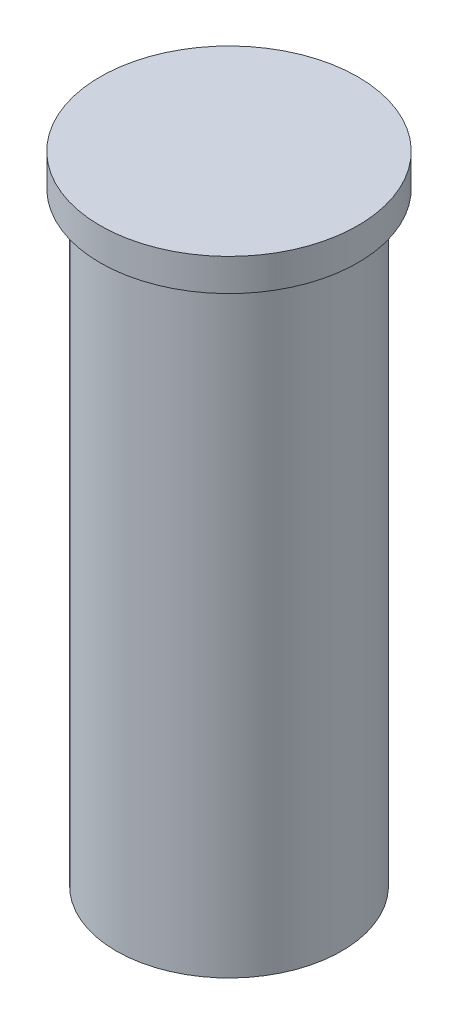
ISO-10303-21;
HEADER;
FILE_DESCRIPTION(('STEP AP214'),'2;1');
FILE_NAME('part.step','',(''),(''),'','','');
FILE_SCHEMA(('AUTOMOTIVE_DESIGN { 1 0 10303 214 1 1 1 1 }'));
ENDSEC;
DATA;
#1=APPLICATION_CONTEXT('core data for automotive mechanical design processes');
#2=APPLICATION_PROTOCOL_DEFINITION('international standard','automotive_design',2000,#1);
#3=PRODUCT_CONTEXT('',#1,'mechanical');
#4=PRODUCT('Part','Part','',(#3));
#5=PRODUCT_RELATED_PRODUCT_CATEGORY('part','',(#4));
#6=PRODUCT_DEFINITION_FORMATION('','',#4);
#7=PRODUCT_DEFINITION_CONTEXT('part definition',#1,'design');
#8=PRODUCT_DEFINITION('design','',#6,#7);
#9=PRODUCT_DEFINITION_SHAPE('','',#8);
#10=(LENGTH_UNIT() NAMED_UNIT(*) SI_UNIT(.MILLI.,.METRE.));
#11=(NAMED_UNIT(*) PLANE_ANGLE_UNIT() SI_UNIT($,.RADIAN.));
#12=(NAMED_UNIT(*) SI_UNIT($,.STERADIAN.) SOLID_ANGLE_UNIT());
#13=UNCERTAINTY_MEASURE_WITH_UNIT(LENGTH_MEASURE(1.E-05),#10,'distance_accuracy_value','');
#14=(GEOMETRIC_REPRESENTATION_CONTEXT(3) GLOBAL_UNCERTAINTY_ASSIGNED_CONTEXT((#13)) GLOBAL_UNIT_ASSIGNED_CONTEXT((#10,
#11,#12)) REPRESENTATION_CONTEXT('',''));
#15=CARTESIAN_POINT('',(0.,0.,0.));
#16=DIRECTION('',(0.,0.,1.));
#17=DIRECTION('',(1.,0.,0.));
#18=AXIS2_PLACEMENT_3D('',#15,#16,#17);
#19=CARTESIAN_POINT('',(1.4,0.,0.));
#20=DIRECTION('',(0.,1.,0.));
#21=DIRECTION('',(0.,0.,1.));
#22=AXIS2_PLACEMENT_3D('',#19,#20,#21);
#23=PLANE('',#22);
#24=CARTESIAN_POINT('',(0.,0.,0.));
#25=DIRECTION('',(0.,1.,0.));
#26=DIRECTION('',(0.,0.,1.));
#27=AXIS2_PLACEMENT_3D('',#24,#25,#26);
#28=CIRCLE('',#27,1.4);
#29=CARTESIAN_POINT('',(0.,0.,1.4));
#30=VERTEX_POINT('',#29);
#31=EDGE_CURVE('E28',#30,#30,#28,.T.);
#32=ORIENTED_EDGE('',*,*,#31,.F.);
#33=EDGE_LOOP('',(#32));
#34=FACE_BOUND('',#33,.T.);
#35=ADVANCED_FACE('F14',(#34),#23,.F.);
#36=CARTESIAN_POINT('',(0.,7.9,0.));
#37=DIRECTION('',(0.,-1.,0.));
#38=DIRECTION('',(0.,0.,-1.));
#39=AXIS2_PLACEMENT_3D('',#36,#37,#38);
#40=PLANE('',#39);
#41=CARTESIAN_POINT('',(0.,7.9,0.));
#42=DIRECTION('',(0.,1.,0.));
#43=DIRECTION('',(0.,0.,1.));
#44=AXIS2_PLACEMENT_3D('',#41,#42,#43);
#45=CIRCLE('',#44,1.6);
#46=CARTESIAN_POINT('',(0.,7.9,1.6));
#47=VERTEX_POINT('',#46);
#48=EDGE_CURVE('E10',#47,#47,#45,.T.);
#49=ORIENTED_EDGE('',*,*,#48,.T.);
#50=EDGE_LOOP('',(#49));
#51=FACE_BOUND('',#50,.T.);
#52=ADVANCED_FACE('F37',(#51),#40,.F.);
#53=CARTESIAN_POINT('',(0.,0.,0.));
#54=DIRECTION('',(0.,1.,0.));
#55=DIRECTION('',(0.,0.,1.));
#56=AXIS2_PLACEMENT_3D('',#53,#54,#55);
#57=CYLINDRICAL_SURFACE('',#56,1.6);
#58=ORIENTED_EDGE('',*,*,#48,.F.);
#59=EDGE_LOOP('',(#58));
#60=FACE_BOUND('',#59,.T.);
#61=CARTESIAN_POINT('',(0.,7.5,0.));
#62=DIRECTION('',(0.,1.,0.));
#63=DIRECTION('',(0.,0.,1.));
#64=AXIS2_PLACEMENT_3D('',#61,#62,#63);
#65=CIRCLE('',#64,1.6);
#66=CARTESIAN_POINT('',(0.,7.5,1.6));
#67=VERTEX_POINT('',#66);
#68=EDGE_CURVE('E20',#67,#67,#65,.T.);
#69=ORIENTED_EDGE('',*,*,#68,.T.);
#70=EDGE_LOOP('',(#69));
#71=FACE_BOUND('',#70,.T.);
#72=ADVANCED_FACE('F43',(#60,#71),#57,.T.);
#73=CARTESIAN_POINT('',(1.6,7.5,0.));
#74=DIRECTION('',(0.,1.,0.));
#75=DIRECTION('',(0.,0.,1.));
#76=AXIS2_PLACEMENT_3D('',#73,#74,#75);
#77=PLANE('',#76);
#78=ORIENTED_EDGE('',*,*,#68,.F.);
#79=EDGE_LOOP('',(#78));
#80=FACE_BOUND('',#79,.T.);
#81=CARTESIAN_POINT('',(0.,7.5,0.));
#82=DIRECTION('',(0.,1.,0.));
#83=DIRECTION('',(0.,0.,1.));
#84=AXIS2_PLACEMENT_3D('',#81,#82,#83);
#85=CIRCLE('',#84,1.4);
#86=CARTESIAN_POINT('',(0.,7.5,1.4));
#87=VERTEX_POINT('',#86);
#88=EDGE_CURVE('E24',#87,#87,#85,.T.);
#89=ORIENTED_EDGE('',*,*,#88,.T.);
#90=EDGE_LOOP('',(#89));
#91=FACE_BOUND('',#90,.T.);
#92=ADVANCED_FACE('F48',(#80,#91),#77,.F.);
#93=CARTESIAN_POINT('',(0.,0.,0.));
#94=DIRECTION('',(0.,1.,0.));
#95=DIRECTION('',(0.,0.,1.));
#96=AXIS2_PLACEMENT_3D('',#93,#94,#95);
#97=CYLINDRICAL_SURFACE('',#96,1.4);
#98=ORIENTED_EDGE('',*,*,#88,.F.);
#99=EDGE_LOOP('',(#98));
#100=FACE_BOUND('',#99,.T.);
#101=ORIENTED_EDGE('',*,*,#31,.T.);
#102=EDGE_LOOP('',(#101));
#103=FACE_BOUND('',#102,.T.);
#104=ADVANCED_FACE('F34',(#100,#103),#97,.T.);
#105=CLOSED_SHELL('',(#35,#52,#72,#92,#104));
#106=MANIFOLD_SOLID_BREP('B1',#105);
#107=ADVANCED_BREP_SHAPE_REPRESENTATION('',(#18,#106),#14);
#108=SHAPE_DEFINITION_REPRESENTATION(#9,#107);
ENDSEC;
END-ISO-10303-21;
